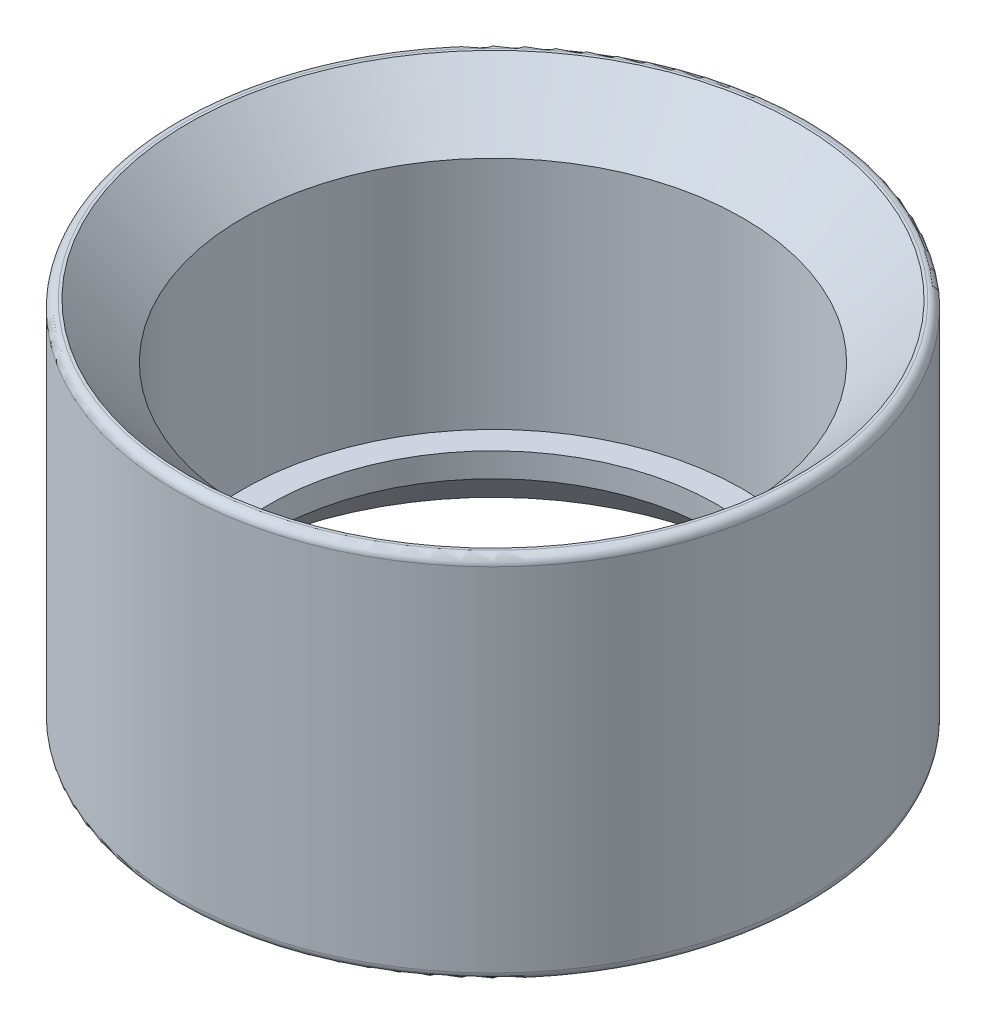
from build123d import *

# Parameters (mm, degrees)
SKETCH1_R           = 19.05
SKETCH1_R_2         = 13.5001
BOSS_EXTRUDE1_DEPTH = 4.7625
SKETCH2_R           = 19.05
SKETCH2_R_2         = 15.08125
BOSS_EXTRUDE2_DEPTH = 17.4625
CHAMFER1_SIZE       = 3.302
FILLET1_R           = 0.508
FILLET2_R           = 0.508
CHAMFER2_SIZE       = 3.302


with BuildPart() as part:
    # Sketch1 → Boss-Extrude1 (new body)
    with BuildSketch(Plane(origin=(0, 0, 0), x_dir=(1, 0, 0), z_dir=(0, 1, 0))):
        with Locations(Location((0, 0, 0), (0, 0, 90))):
            Circle(SKETCH1_R)
        with Locations(Location((0, 0, 0), (0, 0, 90))):
            Circle(SKETCH1_R_2, mode=Mode.SUBTRACT)
    extrude(amount=BOSS_EXTRUDE1_DEPTH)

    # Sketch2 → Boss-Extrude2 (add)
    with BuildSketch(Plane(origin=(0, 4.7625, 0), x_dir=(1, 0, 0), z_dir=(0, 1, 0))):
        with Locations(Location((0, 0, 0), (0, 0, 90))):
            Circle(SKETCH2_R)
        with Locations(Location((0, 0, 0), (0, 0, 270))):
            Circle(SKETCH2_R_2, mode=Mode.SUBTRACT)
    extrude(amount=BOSS_EXTRUDE2_DEPTH)

    # Chamfer1
    chamfer1_edges = [part.edges().sort_by_distance(p)[0] for p in [
        (0, 0, 13.5001),
    ]]
    chamfer(chamfer1_edges, length=CHAMFER1_SIZE)

    # Fillet1
    fillet1_edges = [part.edges().sort_by_distance(p)[0] for p in [
        (0, 0, 19.05),
    ]]
    fillet(fillet1_edges, radius=FILLET1_R)

    # Fillet2
    fillet2_edges = [part.edges().sort_by_distance(p)[0] for p in [
        (0, 22.225, 19.05),
    ]]
    fillet(fillet2_edges, radius=FILLET2_R)

    # Chamfer2
    chamfer2_edges = [part.edges().sort_by_distance(p)[0] for p in [
        (0, 22.225, -15.08125),
    ]]
    chamfer(chamfer2_edges, length=CHAMFER2_SIZE)


solid = part.part
